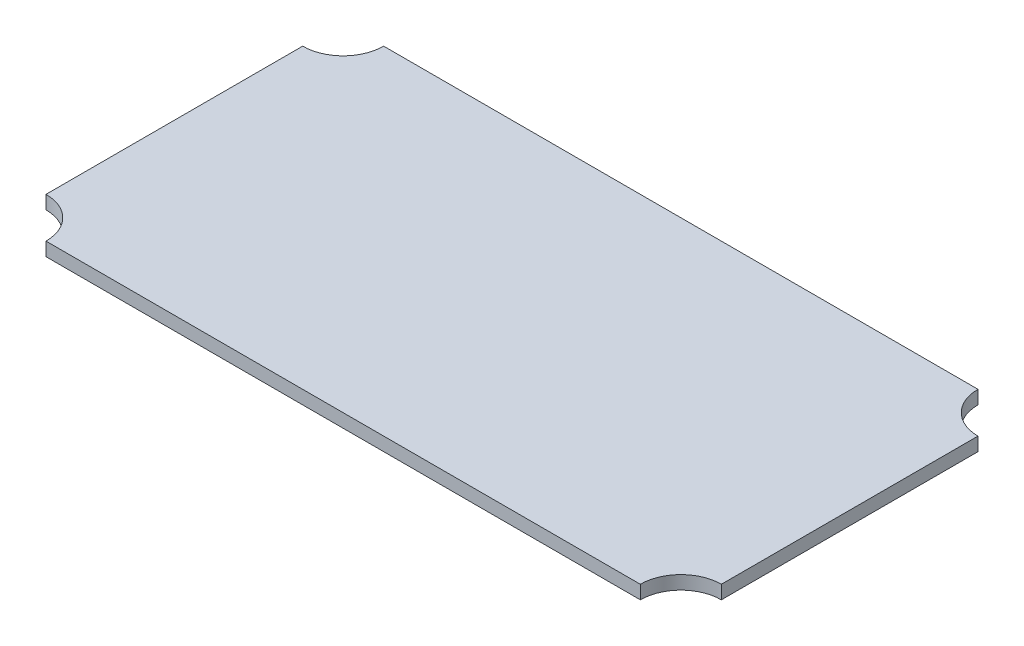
ISO-10303-21;
HEADER;
FILE_DESCRIPTION(('STEP AP214'),'2;1');
FILE_NAME('part.step','',(''),(''),'','','');
FILE_SCHEMA(('AUTOMOTIVE_DESIGN { 1 0 10303 214 1 1 1 1 }'));
ENDSEC;
DATA;
#1=APPLICATION_CONTEXT('core data for automotive mechanical design processes');
#2=APPLICATION_PROTOCOL_DEFINITION('international standard','automotive_design',2000,#1);
#3=PRODUCT_CONTEXT('',#1,'mechanical');
#4=PRODUCT('Part','Part','',(#3));
#5=PRODUCT_RELATED_PRODUCT_CATEGORY('part','',(#4));
#6=PRODUCT_DEFINITION_FORMATION('','',#4);
#7=PRODUCT_DEFINITION_CONTEXT('part definition',#1,'design');
#8=PRODUCT_DEFINITION('design','',#6,#7);
#9=PRODUCT_DEFINITION_SHAPE('','',#8);
#10=(LENGTH_UNIT() NAMED_UNIT(*) SI_UNIT(.MILLI.,.METRE.));
#11=(NAMED_UNIT(*) PLANE_ANGLE_UNIT() SI_UNIT($,.RADIAN.));
#12=(NAMED_UNIT(*) SI_UNIT($,.STERADIAN.) SOLID_ANGLE_UNIT());
#13=UNCERTAINTY_MEASURE_WITH_UNIT(LENGTH_MEASURE(1.E-05),#10,'distance_accuracy_value','');
#14=(GEOMETRIC_REPRESENTATION_CONTEXT(3) GLOBAL_UNCERTAINTY_ASSIGNED_CONTEXT((#13)) GLOBAL_UNIT_ASSIGNED_CONTEXT((#10,
#11,#12)) REPRESENTATION_CONTEXT('',''));
#15=CARTESIAN_POINT('',(0.,0.,0.));
#16=DIRECTION('',(0.,0.,1.));
#17=DIRECTION('',(1.,0.,0.));
#18=AXIS2_PLACEMENT_3D('',#15,#16,#17);
#19=CARTESIAN_POINT('',(-250.,5.,125.));
#20=DIRECTION('',(1.,0.,0.));
#21=DIRECTION('',(0.,0.,-1.));
#22=AXIS2_PLACEMENT_3D('',#19,#20,#21);
#23=PLANE('',#22);
#24=DIRECTION('',(0.,0.,1.));
#25=VECTOR('',#24,1.);
#26=CARTESIAN_POINT('',(-250.,5.,125.));
#27=LINE('',#26,#25);
#28=CARTESIAN_POINT('',(-250.,5.,-95.));
#29=VERTEX_POINT('',#28);
#30=CARTESIAN_POINT('',(-250.,5.,95.));
#31=VERTEX_POINT('',#30);
#32=EDGE_CURVE('E107',#29,#31,#27,.T.);
#33=ORIENTED_EDGE('',*,*,#32,.F.);
#34=DIRECTION('',(0.,1.,0.));
#35=VECTOR('',#34,1.);
#36=CARTESIAN_POINT('',(-250.,-5.,-95.));
#37=LINE('',#36,#35);
#38=CARTESIAN_POINT('',(-250.,-5.,-95.));
#39=VERTEX_POINT('',#38);
#40=EDGE_CURVE('E136',#29,#39,#37,.F.);
#41=ORIENTED_EDGE('',*,*,#40,.T.);
#42=DIRECTION('',(0.,0.,1.));
#43=VECTOR('',#42,1.);
#44=CARTESIAN_POINT('',(-250.,-5.,125.));
#45=LINE('',#44,#43);
#46=CARTESIAN_POINT('',(-250.,-5.,95.));
#47=VERTEX_POINT('',#46);
#48=EDGE_CURVE('E109',#39,#47,#45,.T.);
#49=ORIENTED_EDGE('',*,*,#48,.T.);
#50=DIRECTION('',(0.,1.,0.));
#51=VECTOR('',#50,1.);
#52=CARTESIAN_POINT('',(-250.,-5.,95.));
#53=LINE('',#52,#51);
#54=EDGE_CURVE('E154',#47,#31,#53,.T.);
#55=ORIENTED_EDGE('',*,*,#54,.T.);
#56=EDGE_LOOP('',(#33,#41,#49,#55));
#57=FACE_BOUND('',#56,.T.);
#58=ADVANCED_FACE('F26',(#57),#23,.F.);
#59=CARTESIAN_POINT('',(-250.,5.,125.));
#60=DIRECTION('',(0.,0.,-1.));
#61=DIRECTION('',(-1.,0.,0.));
#62=AXIS2_PLACEMENT_3D('',#59,#60,#61);
#63=PLANE('',#62);
#64=DIRECTION('',(1.,0.,0.));
#65=VECTOR('',#64,1.);
#66=CARTESIAN_POINT('',(-250.,-5.,125.));
#67=LINE('',#66,#65);
#68=CARTESIAN_POINT('',(-220.,-5.,125.));
#69=VERTEX_POINT('',#68);
#70=CARTESIAN_POINT('',(220.,-5.,125.));
#71=VERTEX_POINT('',#70);
#72=EDGE_CURVE('E105',#69,#71,#67,.T.);
#73=ORIENTED_EDGE('',*,*,#72,.T.);
#74=DIRECTION('',(0.,1.,0.));
#75=VECTOR('',#74,1.);
#76=CARTESIAN_POINT('',(220.,-5.,125.));
#77=LINE('',#76,#75);
#78=CARTESIAN_POINT('',(220.,5.,125.));
#79=VERTEX_POINT('',#78);
#80=EDGE_CURVE('E40',#71,#79,#77,.T.);
#81=ORIENTED_EDGE('',*,*,#80,.T.);
#82=DIRECTION('',(1.,0.,0.));
#83=VECTOR('',#82,1.);
#84=CARTESIAN_POINT('',(-250.,5.,125.));
#85=LINE('',#84,#83);
#86=CARTESIAN_POINT('',(-220.,5.,125.));
#87=VERTEX_POINT('',#86);
#88=EDGE_CURVE('E114',#87,#79,#85,.T.);
#89=ORIENTED_EDGE('',*,*,#88,.F.);
#90=DIRECTION('',(0.,1.,0.));
#91=VECTOR('',#90,1.);
#92=CARTESIAN_POINT('',(-220.,-5.,125.));
#93=LINE('',#92,#91);
#94=EDGE_CURVE('E151',#87,#69,#93,.F.);
#95=ORIENTED_EDGE('',*,*,#94,.T.);
#96=EDGE_LOOP('',(#73,#81,#89,#95));
#97=FACE_BOUND('',#96,.T.);
#98=ADVANCED_FACE('F163',(#97),#63,.F.);
#99=CARTESIAN_POINT('',(250.,5.,125.));
#100=DIRECTION('',(-1.,0.,0.));
#101=DIRECTION('',(0.,0.,1.));
#102=AXIS2_PLACEMENT_3D('',#99,#100,#101);
#103=PLANE('',#102);
#104=DIRECTION('',(0.,0.,-1.));
#105=VECTOR('',#104,1.);
#106=CARTESIAN_POINT('',(250.,5.,125.));
#107=LINE('',#106,#105);
#108=CARTESIAN_POINT('',(250.,5.,95.));
#109=VERTEX_POINT('',#108);
#110=CARTESIAN_POINT('',(250.,5.,-95.));
#111=VERTEX_POINT('',#110);
#112=EDGE_CURVE('E99',#109,#111,#107,.T.);
#113=ORIENTED_EDGE('',*,*,#112,.F.);
#114=DIRECTION('',(0.,1.,0.));
#115=VECTOR('',#114,1.);
#116=CARTESIAN_POINT('',(250.,-5.,95.));
#117=LINE('',#116,#115);
#118=CARTESIAN_POINT('',(250.,-5.,95.));
#119=VERTEX_POINT('',#118);
#120=EDGE_CURVE('E90',#109,#119,#117,.F.);
#121=ORIENTED_EDGE('',*,*,#120,.T.);
#122=DIRECTION('',(0.,0.,-1.));
#123=VECTOR('',#122,1.);
#124=CARTESIAN_POINT('',(250.,-5.,125.));
#125=LINE('',#124,#123);
#126=CARTESIAN_POINT('',(250.,-5.,-95.));
#127=VERTEX_POINT('',#126);
#128=EDGE_CURVE('E48',#119,#127,#125,.T.);
#129=ORIENTED_EDGE('',*,*,#128,.T.);
#130=DIRECTION('',(0.,1.,0.));
#131=VECTOR('',#130,1.);
#132=CARTESIAN_POINT('',(250.,-5.,-95.));
#133=LINE('',#132,#131);
#134=EDGE_CURVE('E138',#127,#111,#133,.T.);
#135=ORIENTED_EDGE('',*,*,#134,.T.);
#136=EDGE_LOOP('',(#113,#121,#129,#135));
#137=FACE_BOUND('',#136,.T.);
#138=ADVANCED_FACE('F98',(#137),#103,.F.);
#139=CARTESIAN_POINT('',(-250.,5.,-125.));
#140=DIRECTION('',(0.,0.,1.));
#141=DIRECTION('',(1.,0.,0.));
#142=AXIS2_PLACEMENT_3D('',#139,#140,#141);
#143=PLANE('',#142);
#144=DIRECTION('',(-1.,0.,0.));
#145=VECTOR('',#144,1.);
#146=CARTESIAN_POINT('',(-250.,5.,-125.));
#147=LINE('',#146,#145);
#148=CARTESIAN_POINT('',(220.,5.,-125.));
#149=VERTEX_POINT('',#148);
#150=CARTESIAN_POINT('',(-220.,5.,-125.));
#151=VERTEX_POINT('',#150);
#152=EDGE_CURVE('E33',#149,#151,#147,.T.);
#153=ORIENTED_EDGE('',*,*,#152,.F.);
#154=DIRECTION('',(0.,1.,0.));
#155=VECTOR('',#154,1.);
#156=CARTESIAN_POINT('',(220.,-5.,-125.));
#157=LINE('',#156,#155);
#158=CARTESIAN_POINT('',(220.,-5.,-125.));
#159=VERTEX_POINT('',#158);
#160=EDGE_CURVE('E169',#149,#159,#157,.F.);
#161=ORIENTED_EDGE('',*,*,#160,.T.);
#162=DIRECTION('',(-1.,0.,0.));
#163=VECTOR('',#162,1.);
#164=CARTESIAN_POINT('',(-250.,-5.,-125.));
#165=LINE('',#164,#163);
#166=CARTESIAN_POINT('',(-220.,-5.,-125.));
#167=VERTEX_POINT('',#166);
#168=EDGE_CURVE('E104',#159,#167,#165,.T.);
#169=ORIENTED_EDGE('',*,*,#168,.T.);
#170=DIRECTION('',(0.,1.,0.));
#171=VECTOR('',#170,1.);
#172=CARTESIAN_POINT('',(-220.,-5.,-125.));
#173=LINE('',#172,#171);
#174=EDGE_CURVE('E133',#167,#151,#173,.T.);
#175=ORIENTED_EDGE('',*,*,#174,.T.);
#176=EDGE_LOOP('',(#153,#161,#169,#175));
#177=FACE_BOUND('',#176,.T.);
#178=ADVANCED_FACE('F140',(#177),#143,.F.);
#179=CARTESIAN_POINT('',(-250.,5.,-125.));
#180=DIRECTION('',(0.,-1.,0.));
#181=DIRECTION('',(0.,0.,-1.));
#182=AXIS2_PLACEMENT_3D('',#179,#180,#181);
#183=PLANE('',#182);
#184=ORIENTED_EDGE('',*,*,#88,.T.);
#185=CARTESIAN_POINT('',(250.,5.,125.));
#186=DIRECTION('',(0.,1.,0.));
#187=DIRECTION('',(0.,0.,1.));
#188=AXIS2_PLACEMENT_3D('',#185,#186,#187);
#189=CIRCLE('',#188,30.);
#190=EDGE_CURVE('E95',#109,#79,#189,.T.);
#191=ORIENTED_EDGE('',*,*,#190,.F.);
#192=ORIENTED_EDGE('',*,*,#112,.T.);
#193=CARTESIAN_POINT('',(250.,5.,-125.));
#194=DIRECTION('',(0.,1.,0.));
#195=DIRECTION('',(0.,0.,1.));
#196=AXIS2_PLACEMENT_3D('',#193,#194,#195);
#197=CIRCLE('',#196,30.);
#198=EDGE_CURVE('E126',#149,#111,#197,.T.);
#199=ORIENTED_EDGE('',*,*,#198,.F.);
#200=ORIENTED_EDGE('',*,*,#152,.T.);
#201=CARTESIAN_POINT('',(-250.,5.,-125.));
#202=DIRECTION('',(0.,1.,0.));
#203=DIRECTION('',(0.,0.,1.));
#204=AXIS2_PLACEMENT_3D('',#201,#202,#203);
#205=CIRCLE('',#204,30.);
#206=EDGE_CURVE('E123',#29,#151,#205,.T.);
#207=ORIENTED_EDGE('',*,*,#206,.F.);
#208=ORIENTED_EDGE('',*,*,#32,.T.);
#209=CARTESIAN_POINT('',(-250.,5.,125.));
#210=DIRECTION('',(0.,1.,0.));
#211=DIRECTION('',(0.,0.,1.));
#212=AXIS2_PLACEMENT_3D('',#209,#210,#211);
#213=CIRCLE('',#212,30.);
#214=EDGE_CURVE('E142',#87,#31,#213,.T.);
#215=ORIENTED_EDGE('',*,*,#214,.F.);
#216=EDGE_LOOP('',(#184,#191,#192,#199,#200,#207,#208,#215));
#217=FACE_BOUND('',#216,.T.);
#218=ADVANCED_FACE('F122',(#217),#183,.F.);
#219=CARTESIAN_POINT('',(-250.,-5.,-125.));
#220=DIRECTION('',(0.,-1.,0.));
#221=DIRECTION('',(0.,0.,-1.));
#222=AXIS2_PLACEMENT_3D('',#219,#220,#221);
#223=PLANE('',#222);
#224=CARTESIAN_POINT('',(250.,-5.,125.));
#225=DIRECTION('',(0.,1.,0.));
#226=DIRECTION('',(0.,0.,1.));
#227=AXIS2_PLACEMENT_3D('',#224,#225,#226);
#228=CIRCLE('',#227,30.);
#229=EDGE_CURVE('E88',#119,#71,#228,.T.);
#230=ORIENTED_EDGE('',*,*,#229,.T.);
#231=ORIENTED_EDGE('',*,*,#72,.F.);
#232=CARTESIAN_POINT('',(-250.,-5.,125.));
#233=DIRECTION('',(0.,1.,0.));
#234=DIRECTION('',(0.,0.,1.));
#235=AXIS2_PLACEMENT_3D('',#232,#233,#234);
#236=CIRCLE('',#235,30.);
#237=EDGE_CURVE('E148',#69,#47,#236,.T.);
#238=ORIENTED_EDGE('',*,*,#237,.T.);
#239=ORIENTED_EDGE('',*,*,#48,.F.);
#240=CARTESIAN_POINT('',(-250.,-5.,-125.));
#241=DIRECTION('',(0.,1.,0.));
#242=DIRECTION('',(0.,0.,1.));
#243=AXIS2_PLACEMENT_3D('',#240,#241,#242);
#244=CIRCLE('',#243,30.);
#245=EDGE_CURVE('E137',#39,#167,#244,.T.);
#246=ORIENTED_EDGE('',*,*,#245,.T.);
#247=ORIENTED_EDGE('',*,*,#168,.F.);
#248=CARTESIAN_POINT('',(250.,-5.,-125.));
#249=DIRECTION('',(0.,-1.,0.));
#250=DIRECTION('',(0.,0.,-1.));
#251=AXIS2_PLACEMENT_3D('',#248,#249,#250);
#252=CIRCLE('',#251,30.);
#253=EDGE_CURVE('E11',#127,#159,#252,.T.);
#254=ORIENTED_EDGE('',*,*,#253,.F.);
#255=ORIENTED_EDGE('',*,*,#128,.F.);
#256=EDGE_LOOP('',(#230,#231,#238,#239,#246,#247,#254,#255));
#257=FACE_BOUND('',#256,.T.);
#258=ADVANCED_FACE('F102',(#257),#223,.T.);
#259=CARTESIAN_POINT('',(-250.,-5.,125.));
#260=DIRECTION('',(0.,1.,0.));
#261=DIRECTION('',(0.,0.,1.));
#262=AXIS2_PLACEMENT_3D('',#259,#260,#261);
#263=CYLINDRICAL_SURFACE('',#262,30.);
#264=ORIENTED_EDGE('',*,*,#237,.F.);
#265=ORIENTED_EDGE('',*,*,#94,.F.);
#266=ORIENTED_EDGE('',*,*,#214,.T.);
#267=ORIENTED_EDGE('',*,*,#54,.F.);
#268=EDGE_LOOP('',(#264,#265,#266,#267));
#269=FACE_BOUND('',#268,.T.);
#270=ADVANCED_FACE('F160',(#269),#263,.F.);
#271=CARTESIAN_POINT('',(-250.,-5.,-125.));
#272=DIRECTION('',(0.,1.,0.));
#273=DIRECTION('',(0.,0.,1.));
#274=AXIS2_PLACEMENT_3D('',#271,#272,#273);
#275=CYLINDRICAL_SURFACE('',#274,30.);
#276=ORIENTED_EDGE('',*,*,#206,.T.);
#277=ORIENTED_EDGE('',*,*,#174,.F.);
#278=ORIENTED_EDGE('',*,*,#245,.F.);
#279=ORIENTED_EDGE('',*,*,#40,.F.);
#280=EDGE_LOOP('',(#276,#277,#278,#279));
#281=FACE_BOUND('',#280,.T.);
#282=ADVANCED_FACE('F132',(#281),#275,.F.);
#283=CARTESIAN_POINT('',(250.,-5.,-125.));
#284=DIRECTION('',(0.,1.,0.));
#285=DIRECTION('',(0.,0.,1.));
#286=AXIS2_PLACEMENT_3D('',#283,#284,#285);
#287=CYLINDRICAL_SURFACE('',#286,30.);
#288=ORIENTED_EDGE('',*,*,#253,.T.);
#289=ORIENTED_EDGE('',*,*,#160,.F.);
#290=ORIENTED_EDGE('',*,*,#198,.T.);
#291=ORIENTED_EDGE('',*,*,#134,.F.);
#292=EDGE_LOOP('',(#288,#289,#290,#291));
#293=FACE_BOUND('',#292,.T.);
#294=ADVANCED_FACE('F172',(#293),#287,.F.);
#295=CARTESIAN_POINT('',(250.,-5.,125.));
#296=DIRECTION('',(0.,1.,0.));
#297=DIRECTION('',(0.,0.,1.));
#298=AXIS2_PLACEMENT_3D('',#295,#296,#297);
#299=CYLINDRICAL_SURFACE('',#298,30.);
#300=ORIENTED_EDGE('',*,*,#229,.F.);
#301=ORIENTED_EDGE('',*,*,#120,.F.);
#302=ORIENTED_EDGE('',*,*,#190,.T.);
#303=ORIENTED_EDGE('',*,*,#80,.F.);
#304=EDGE_LOOP('',(#300,#301,#302,#303));
#305=FACE_BOUND('',#304,.T.);
#306=ADVANCED_FACE('F89',(#305),#299,.F.);
#307=CLOSED_SHELL('',(#58,#98,#138,#178,#218,#258,#270,#282,#294,#306));
#308=MANIFOLD_SOLID_BREP('B2',#307);
#309=ADVANCED_BREP_SHAPE_REPRESENTATION('',(#18,#308),#14);
#310=SHAPE_DEFINITION_REPRESENTATION(#9,#309);
ENDSEC;
END-ISO-10303-21;
